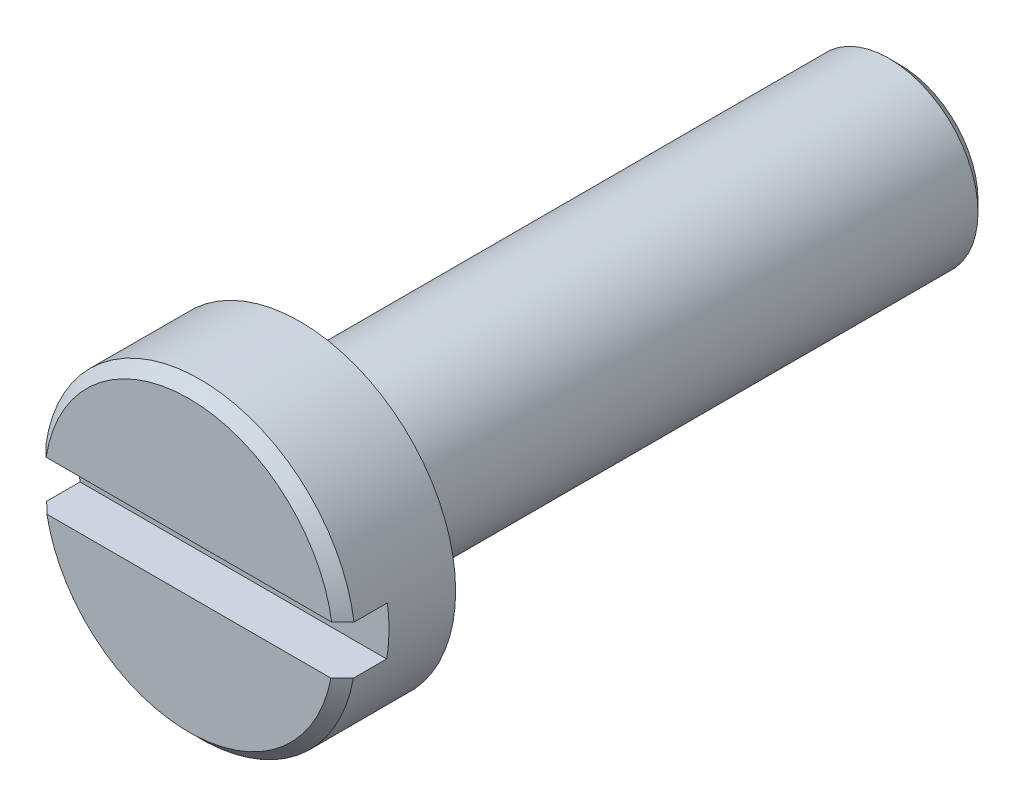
ISO-10303-21;
HEADER;
FILE_DESCRIPTION(('STEP AP214'),'2;1');
FILE_NAME('part.step','',(''),(''),'','','');
FILE_SCHEMA(('AUTOMOTIVE_DESIGN { 1 0 10303 214 1 1 1 1 }'));
ENDSEC;
DATA;
#1=APPLICATION_CONTEXT('core data for automotive mechanical design processes');
#2=APPLICATION_PROTOCOL_DEFINITION('international standard','automotive_design',2000,#1);
#3=PRODUCT_CONTEXT('',#1,'mechanical');
#4=PRODUCT('Part','Part','',(#3));
#5=PRODUCT_RELATED_PRODUCT_CATEGORY('part','',(#4));
#6=PRODUCT_DEFINITION_FORMATION('','',#4);
#7=PRODUCT_DEFINITION_CONTEXT('part definition',#1,'design');
#8=PRODUCT_DEFINITION('design','',#6,#7);
#9=PRODUCT_DEFINITION_SHAPE('','',#8);
#10=(LENGTH_UNIT() NAMED_UNIT(*) SI_UNIT(.MILLI.,.METRE.));
#11=(NAMED_UNIT(*) PLANE_ANGLE_UNIT() SI_UNIT($,.RADIAN.));
#12=(NAMED_UNIT(*) SI_UNIT($,.STERADIAN.) SOLID_ANGLE_UNIT());
#13=UNCERTAINTY_MEASURE_WITH_UNIT(LENGTH_MEASURE(1.E-05),#10,'distance_accuracy_value','');
#14=(GEOMETRIC_REPRESENTATION_CONTEXT(3) GLOBAL_UNCERTAINTY_ASSIGNED_CONTEXT((#13)) GLOBAL_UNIT_ASSIGNED_CONTEXT((#10,
#11,#12)) REPRESENTATION_CONTEXT('',''));
#15=CARTESIAN_POINT('',(0.,0.,0.));
#16=DIRECTION('',(0.,0.,1.));
#17=DIRECTION('',(1.,0.,0.));
#18=AXIS2_PLACEMENT_3D('',#15,#16,#17);
#19=CARTESIAN_POINT('',(0.,0.,0.));
#20=DIRECTION('',(0.,0.,-1.));
#21=DIRECTION('',(-1.,0.,0.));
#22=AXIS2_PLACEMENT_3D('',#19,#20,#21);
#23=PLANE('',#22);
#24=CARTESIAN_POINT('',(0.,0.,0.));
#25=DIRECTION('',(0.,0.,-1.));
#26=DIRECTION('',(-1.,0.,0.));
#27=AXIS2_PLACEMENT_3D('',#24,#25,#26);
#28=CIRCLE('',#27,20.6375);
#29=CARTESIAN_POINT('',(20.3918067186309,3.175,0.));
#30=VERTEX_POINT('',#29);
#31=CARTESIAN_POINT('',(-20.3918067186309,3.175,0.));
#32=VERTEX_POINT('',#31);
#33=EDGE_CURVE('E133',#30,#32,#28,.F.);
#34=ORIENTED_EDGE('',*,*,#33,.T.);
#35=DIRECTION('',(-1.,0.,0.));
#36=VECTOR('',#35,1.);
#37=CARTESIAN_POINT('',(-21.9970452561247,3.175,0.));
#38=LINE('',#37,#36);
#39=EDGE_CURVE('E107',#30,#32,#38,.T.);
#40=ORIENTED_EDGE('',*,*,#39,.F.);
#41=EDGE_LOOP('',(#34,#40));
#42=FACE_BOUND('',#41,.T.);
#43=ADVANCED_FACE('F34',(#42),#23,.F.);
#44=CARTESIAN_POINT('',(0.,0.,0.));
#45=DIRECTION('',(0.,0.,-1.));
#46=DIRECTION('',(-1.,0.,0.));
#47=AXIS2_PLACEMENT_3D('',#44,#45,#46);
#48=CONICAL_SURFACE('',#47,20.6375,0.785398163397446);
#49=CARTESIAN_POINT('',(48.4108791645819,3.175,-27.8773827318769));
#50=CARTESIAN_POINT('',(46.7448659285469,3.175,-26.2149705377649));
#51=CARTESIAN_POINT('',(45.0786964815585,3.175,-24.5527147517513));
#52=CARTESIAN_POINT('',(41.7458081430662,3.175,-21.2286870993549));
#53=CARTESIAN_POINT('',(40.0790892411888,3.175,-19.5669152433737));
#54=CARTESIAN_POINT('',(36.7441758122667,3.175,-16.243339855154));
#55=CARTESIAN_POINT('',(35.0759809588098,3.175,-14.5815366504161));
#56=CARTESIAN_POINT('',(31.7385378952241,3.175,-11.2590534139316));
#57=CARTESIAN_POINT('',(30.0692897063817,3.175,-9.59837336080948));
#58=CARTESIAN_POINT('',(27.5540482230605,3.175,-7.09871347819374));
#59=CARTESIAN_POINT('',(26.708714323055,3.175,-6.25907019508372));
#60=CARTESIAN_POINT('',(25.0174396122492,3.175,-4.58039517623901));
#61=CARTESIAN_POINT('',(24.1714988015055,3.175,-3.7413634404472));
#62=CARTESIAN_POINT('',(22.4787457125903,3.175,-2.06407637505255));
#63=CARTESIAN_POINT('',(21.6319333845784,3.175,-1.22582109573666));
#64=CARTESIAN_POINT('',(19.9371605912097,3.175,0.449518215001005));
#65=CARTESIAN_POINT('',(19.0892001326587,3.175,1.28660225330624));
#66=CARTESIAN_POINT('',(17.3918403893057,3.175,2.95883094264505));
#67=CARTESIAN_POINT('',(16.5424415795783,3.175,3.79397607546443));
#68=CARTESIAN_POINT('',(15.2663654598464,3.175,5.04469611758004));
#69=CARTESIAN_POINT('',(14.8406720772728,3.175,5.46127474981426));
#70=CARTESIAN_POINT('',(13.9884364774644,3.175,6.29356264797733));
#71=CARTESIAN_POINT('',(13.5618942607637,3.175,6.70927191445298));
#72=CARTESIAN_POINT('',(12.707747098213,3.175,7.53950827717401));
#73=CARTESIAN_POINT('',(12.2801422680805,3.175,7.95403549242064));
#74=CARTESIAN_POINT('',(11.4234486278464,3.175,8.78155291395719));
#75=CARTESIAN_POINT('',(10.9943598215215,3.175,9.19454312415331));
#76=CARTESIAN_POINT('',(10.1341408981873,3.175,10.018361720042));
#77=CARTESIAN_POINT('',(9.70301085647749,3.175,10.4291901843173));
#78=CARTESIAN_POINT('',(8.83780924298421,3.175,11.2477356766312));
#79=CARTESIAN_POINT('',(8.40373771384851,3.175,11.6554527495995));
#80=CARTESIAN_POINT('',(7.84908814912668,3.175,12.1706862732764));
#81=CARTESIAN_POINT('',(7.73058536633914,3.175,12.2804371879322));
#82=CARTESIAN_POINT('',(7.49320021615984,3.175,12.4995287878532));
#83=CARTESIAN_POINT('',(7.37431784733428,3.175,12.6088694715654));
#84=CARTESIAN_POINT('',(7.13612183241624,3.175,12.8270851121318));
#85=CARTESIAN_POINT('',(7.0168081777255,3.175,12.9359600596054));
#86=CARTESIAN_POINT('',(6.77768977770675,3.175,13.1531690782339));
#87=CARTESIAN_POINT('',(6.65788503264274,3.175,13.2615031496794));
#88=CARTESIAN_POINT('',(6.29770692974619,3.175,13.5855008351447));
#89=CARTESIAN_POINT('',(6.05649197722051,3.175,13.8002313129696));
#90=CARTESIAN_POINT('',(5.57106720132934,3.175,14.2262732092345));
#91=CARTESIAN_POINT('',(5.32685750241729,3.175,14.4375847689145));
#92=CARTESIAN_POINT('',(4.89899238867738,3.175,14.8004179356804));
#93=CARTESIAN_POINT('',(4.71628828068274,3.175,14.9530591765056));
#94=CARTESIAN_POINT('',(4.34791082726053,3.175,15.2547729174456));
#95=CARTESIAN_POINT('',(4.16223716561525,3.175,15.4038450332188));
#96=CARTESIAN_POINT('',(3.78679947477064,3.175,15.6971840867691));
#97=CARTESIAN_POINT('',(3.59703132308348,3.175,15.8414457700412));
#98=CARTESIAN_POINT('',(3.21228765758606,3.175,16.1228440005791));
#99=CARTESIAN_POINT('',(3.01731344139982,3.175,16.2599822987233));
#100=CARTESIAN_POINT('',(2.69305087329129,3.175,16.4752446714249));
#101=CARTESIAN_POINT('',(2.56589455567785,3.175,16.5565678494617));
#102=CARTESIAN_POINT('',(2.30806509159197,3.175,16.7135597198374));
#103=CARTESIAN_POINT('',(2.17739114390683,3.175,16.7892271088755));
#104=CARTESIAN_POINT('',(1.91209259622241,3.175,16.9328676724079));
#105=CARTESIAN_POINT('',(1.77747418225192,3.175,17.0008521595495));
#106=CARTESIAN_POINT('',(1.50353169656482,3.175,17.1265958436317));
#107=CARTESIAN_POINT('',(1.36421045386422,3.175,17.1843610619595));
#108=CARTESIAN_POINT('',(1.1295248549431,3.175,17.2686801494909));
#109=CARTESIAN_POINT('',(1.03556404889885,3.175,17.2991287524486));
#110=CARTESIAN_POINT('',(0.845678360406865,3.175,17.353064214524));
#111=CARTESIAN_POINT('',(0.749754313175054,3.175,17.3765539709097));
#112=CARTESIAN_POINT('',(0.556561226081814,3.175,17.4154713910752));
#113=CARTESIAN_POINT('',(0.459297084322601,3.175,17.4309230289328));
#114=CARTESIAN_POINT('',(0.263765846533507,3.175,17.4530426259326));
#115=CARTESIAN_POINT('',(0.1654988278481,3.175,17.4597112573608));
#116=CARTESIAN_POINT('',(-0.0317508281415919,3.175,17.4638803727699));
#117=CARTESIAN_POINT('',(-0.130734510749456,3.175,17.4613324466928));
#118=CARTESIAN_POINT('',(-0.328037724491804,3.175,17.4471165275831));
#119=CARTESIAN_POINT('',(-0.426357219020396,3.175,17.4354480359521));
#120=CARTESIAN_POINT('',(-0.621827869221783,3.175,17.4036222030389));
#121=CARTESIAN_POINT('',(-0.718975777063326,3.175,17.3834451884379));
#122=CARTESIAN_POINT('',(-0.91138277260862,3.175,17.3355980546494));
#123=CARTESIAN_POINT('',(-1.00664165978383,3.175,17.3079271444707));
#124=CARTESIAN_POINT('',(-1.29457057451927,3.175,17.2136157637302));
#125=CARTESIAN_POINT('',(-1.48389036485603,3.175,17.1366783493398));
#126=CARTESIAN_POINT('',(-1.76133338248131,3.175,17.007593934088));
#127=CARTESIAN_POINT('',(-1.8528173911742,3.175,16.9622313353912));
#128=CARTESIAN_POINT('',(-2.03382268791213,3.175,16.8677387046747));
#129=CARTESIAN_POINT('',(-2.12334426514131,3.175,16.8186092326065));
#130=CARTESIAN_POINT('',(-2.30133097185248,3.175,16.7168655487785));
#131=CARTESIAN_POINT('',(-2.38978166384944,3.175,16.664226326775));
#132=CARTESIAN_POINT('',(-2.56509891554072,3.175,16.5563747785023));
#133=CARTESIAN_POINT('',(-2.65196544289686,3.175,16.5011623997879));
#134=CARTESIAN_POINT('',(-2.8242278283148,3.175,16.388660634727));
#135=CARTESIAN_POINT('',(-2.9096249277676,3.175,16.3313731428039));
#136=CARTESIAN_POINT('',(-3.0791953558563,3.175,16.2150262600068));
#137=CARTESIAN_POINT('',(-3.16336872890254,3.175,16.1559669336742));
#138=CARTESIAN_POINT('',(-3.42855103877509,3.175,15.9663751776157));
#139=CARTESIAN_POINT('',(-3.6075936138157,3.175,15.833091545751));
#140=CARTESIAN_POINT('',(-3.9619296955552,3.175,15.5616157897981));
#141=CARTESIAN_POINT('',(-4.13722257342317,3.175,15.423422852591));
#142=CARTESIAN_POINT('',(-4.48500444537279,3.175,15.1433887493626));
#143=CARTESIAN_POINT('',(-4.65749201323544,3.175,15.001545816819));
#144=CARTESIAN_POINT('',(-5.00022285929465,3.175,14.7151689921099));
#145=CARTESIAN_POINT('',(-5.17046604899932,3.175,14.5706349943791));
#146=CARTESIAN_POINT('',(-5.50947908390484,3.175,14.2792401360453));
#147=CARTESIAN_POINT('',(-5.67824572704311,3.175,14.1323755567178));
#148=CARTESIAN_POINT('',(-6.01434716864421,3.175,13.8370155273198));
#149=CARTESIAN_POINT('',(-6.18168194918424,3.175,13.6885200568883));
#150=CARTESIAN_POINT('',(-6.68185050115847,3.175,13.2411926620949));
#151=CARTESIAN_POINT('',(-7.01295465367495,3.175,12.9404277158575));
#152=CARTESIAN_POINT('',(-7.67104263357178,3.175,12.3363762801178));
#153=CARTESIAN_POINT('',(-7.99803574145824,3.175,12.0330998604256));
#154=CARTESIAN_POINT('',(-8.64980355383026,3.175,11.4241266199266));
#155=CARTESIAN_POINT('',(-8.97457809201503,3.175,11.1184296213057));
#156=CARTESIAN_POINT('',(-9.62211308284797,3.175,10.50563089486));
#157=CARTESIAN_POINT('',(-9.94487537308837,3.175,10.1985311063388));
#158=CARTESIAN_POINT('',(-10.5891357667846,3.175,9.58302539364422));
#159=CARTESIAN_POINT('',(-10.9106339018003,3.175,9.27461950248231));
#160=CARTESIAN_POINT('',(-11.8706003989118,3.175,8.35086874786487));
#161=CARTESIAN_POINT('',(-12.507642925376,3.175,7.73404268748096));
#162=CARTESIAN_POINT('',(-13.7793142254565,3.175,6.49790614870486));
#163=CARTESIAN_POINT('',(-14.4139429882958,3.175,5.87859565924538));
#164=CARTESIAN_POINT('',(-15.6815669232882,3.175,4.63827993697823));
#165=CARTESIAN_POINT('',(-16.3145620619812,3.175,4.01727466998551));
#166=CARTESIAN_POINT('',(-17.5793843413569,3.175,2.77407554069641));
#167=CARTESIAN_POINT('',(-18.2112114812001,3.175,2.15188167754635));
#168=CARTESIAN_POINT('',(-20.1059816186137,3.175,0.283470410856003));
#169=CARTESIAN_POINT('',(-21.3676575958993,3.175,-0.96403162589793));
#170=CARTESIAN_POINT('',(-23.8890487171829,3.175,-3.46098988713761));
#171=CARTESIAN_POINT('',(-25.1487638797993,3.175,-4.71044609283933));
#172=CARTESIAN_POINT('',(-27.6667937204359,3.175,-7.21047127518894));
#173=CARTESIAN_POINT('',(-28.9251085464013,3.175,-8.46104010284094));
#174=CARTESIAN_POINT('',(-31.4408967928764,3.175,-10.9630299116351));
#175=CARTESIAN_POINT('',(-32.6983702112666,3.175,-12.214450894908));
#176=CARTESIAN_POINT('',(-36.4696321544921,3.175,-15.9693185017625));
#177=CARTESIAN_POINT('',(-38.9825419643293,3.175,-18.4736476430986));
#178=CARTESIAN_POINT('',(-42.0712766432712,3.175,-21.5533895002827));
#179=CARTESIAN_POINT('',(-42.647700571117,3.175,-22.1282017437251));
#180=CARTESIAN_POINT('',(-43.8004959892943,3.175,-23.2778987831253));
#181=CARTESIAN_POINT('',(-44.3768674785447,3.175,-23.8527835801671));
#182=CARTESIAN_POINT('',(-45.5295455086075,3.175,-25.0025975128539));
#183=CARTESIAN_POINT('',(-46.105852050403,3.175,-25.5775266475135));
#184=CARTESIAN_POINT('',(-47.2584060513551,3.175,-26.7274241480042));
#185=CARTESIAN_POINT('',(-47.8346535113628,3.175,-27.3023925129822));
#186=CARTESIAN_POINT('',(-48.4108791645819,3.175,-27.8773827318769));
#187=B_SPLINE_CURVE_WITH_KNOTS('',3,(#49,#50,#51,#52,#53,#54,#55,#56,#57,#58,#59,#60,#61,#62,
#63,#64,#65,#66,#67,#68,#69,#70,#71,#72,#73,#74,#75,#76,#77,#78,#79,#80,#81,#82,#83,#84,#85,#86,
#87,#88,#89,#90,#91,#92,#93,#94,#95,#96,#97,#98,#99,#100,#101,#102,#103,#104,#105,#106,#107,
#108,#109,#110,#111,#112,#113,#114,#115,#116,#117,#118,#119,#120,#121,#122,#123,#124,#125,#126,
#127,#128,#129,#130,#131,#132,#133,#134,#135,#136,#137,#138,#139,#140,#141,#142,#143,#144,#145,
#146,#147,#148,#149,#150,#151,#152,#153,#154,#155,#156,#157,#158,#159,#160,#161,#162,#163,#164,
#165,#166,#167,#168,#169,#170,#171,#172,#173,#174,#175,#176,#177,#178,#179,#180,#181,#182,#183,
#184,#185,#186),.UNSPECIFIED.,.F.,.F.,(4,2,2,2,2,2,2,2,2,2,2,2,2,2,2,2,2,2,2,2,2,2,2,2,2,2,2,2,
2,2,2,2,2,2,2,2,2,2,2,2,2,2,2,2,2,2,2,2,2,2,2,2,2,2,2,2,2,2,2,2,2,2,2,2,2,2,2,2,4),(0.,
7.06066085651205,14.1214636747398,21.1854690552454,28.2493359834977,31.8237325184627,
35.3981287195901,38.97274216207,42.5473345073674,46.1209152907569,47.9077477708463,
49.6945791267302,51.4812237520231,53.2678638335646,55.0544385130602,56.8409873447,
57.3255415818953,57.8100976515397,58.2946634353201,58.7792289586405,59.7480434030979,
60.7168177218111,61.4310136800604,62.1452862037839,62.8603149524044,63.575167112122,
64.027873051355,64.4806829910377,64.9328172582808,65.3846842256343,65.6807787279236,
65.9767497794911,66.2718329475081,66.5668935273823,66.8635061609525,67.1601350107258,
67.4574535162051,67.7548034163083,68.3661255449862,68.6724293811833,68.9786877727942,
69.2874276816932,69.5961738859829,69.9046450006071,70.2131048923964,70.8825830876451,
71.5521726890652,72.2220926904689,72.8920390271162,73.5631907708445,74.2343509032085,
75.5762496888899,76.9141855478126,78.2522206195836,79.588768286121,80.9252823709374,
83.585472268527,86.2456740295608,88.9059298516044,91.5661875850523,96.8890382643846,
102.211838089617,107.534008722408,112.85619271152,123.499378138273,125.941521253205,
128.383706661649,130.825848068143,133.267947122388),.UNSPECIFIED.);
#188=CARTESIAN_POINT('',(21.9970452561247,3.175,-1.5875));
#189=VERTEX_POINT('',#188);
#190=EDGE_CURVE('E11',#189,#30,#187,.T.);
#191=ORIENTED_EDGE('',*,*,#190,.F.);
#192=CARTESIAN_POINT('',(0.,0.,-1.5875));
#193=DIRECTION('',(0.,0.,-1.));
#194=DIRECTION('',(-1.,0.,0.));
#195=AXIS2_PLACEMENT_3D('',#192,#193,#194);
#196=CIRCLE('',#195,22.225);
#197=CARTESIAN_POINT('',(-21.9970452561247,3.175,-1.5875));
#198=VERTEX_POINT('',#197);
#199=EDGE_CURVE('E137',#198,#189,#196,.T.);
#200=ORIENTED_EDGE('',*,*,#199,.F.);
#201=EDGE_CURVE('E38',#32,#198,#187,.T.);
#202=ORIENTED_EDGE('',*,*,#201,.F.);
#203=ORIENTED_EDGE('',*,*,#33,.F.);
#204=EDGE_LOOP('',(#191,#200,#202,#203));
#205=FACE_BOUND('',#204,.T.);
#206=ADVANCED_FACE('F158',(#205),#48,.T.);
#207=CARTESIAN_POINT('',(-20.2827588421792,-3.81,0.));
#208=VERTEX_POINT('',#207);
#209=CARTESIAN_POINT('',(20.2827588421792,-3.81,0.));
#210=VERTEX_POINT('',#209);
#211=EDGE_CURVE('E134',#208,#210,#28,.F.);
#212=ORIENTED_EDGE('',*,*,#211,.T.);
#213=DIRECTION('',(1.,0.,0.));
#214=VECTOR('',#213,1.);
#215=CARTESIAN_POINT('',(-21.8959933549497,-3.81,0.));
#216=LINE('',#215,#214);
#217=EDGE_CURVE('E54',#208,#210,#216,.T.);
#218=ORIENTED_EDGE('',*,*,#217,.F.);
#219=EDGE_LOOP('',(#212,#218));
#220=FACE_BOUND('',#219,.T.);
#221=ADVANCED_FACE('F36',(#220),#23,.F.);
#222=CARTESIAN_POINT('',(0.,0.,0.));
#223=DIRECTION('',(0.,0.,1.));
#224=DIRECTION('',(1.,0.,0.));
#225=AXIS2_PLACEMENT_3D('',#222,#223,#224);
#226=CYLINDRICAL_SURFACE('',#225,22.225);
#227=CARTESIAN_POINT('',(0.,0.,-6.35));
#228=DIRECTION('',(0.,0.,1.));
#229=DIRECTION('',(1.,0.,0.));
#230=AXIS2_PLACEMENT_3D('',#227,#228,#229);
#231=CIRCLE('',#230,22.225);
#232=CARTESIAN_POINT('',(-21.9970452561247,3.175,-6.35));
#233=VERTEX_POINT('',#232);
#234=CARTESIAN_POINT('',(-21.8959933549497,-3.81,-6.35));
#235=VERTEX_POINT('',#234);
#236=EDGE_CURVE('E99',#233,#235,#231,.T.);
#237=ORIENTED_EDGE('',*,*,#236,.F.);
#238=DIRECTION('',(0.,0.,1.));
#239=VECTOR('',#238,1.);
#240=CARTESIAN_POINT('',(-21.9970452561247,3.175,-6.35));
#241=LINE('',#240,#239);
#242=EDGE_CURVE('E124',#233,#198,#241,.T.);
#243=ORIENTED_EDGE('',*,*,#242,.T.);
#244=ORIENTED_EDGE('',*,*,#199,.T.);
#245=DIRECTION('',(0.,0.,1.));
#246=VECTOR('',#245,1.);
#247=CARTESIAN_POINT('',(21.9970452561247,3.175,-6.35));
#248=LINE('',#247,#246);
#249=CARTESIAN_POINT('',(21.9970452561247,3.175,-6.35));
#250=VERTEX_POINT('',#249);
#251=EDGE_CURVE('E115',#250,#189,#248,.T.);
#252=ORIENTED_EDGE('',*,*,#251,.F.);
#253=CARTESIAN_POINT('',(0.,0.,-6.35));
#254=DIRECTION('',(0.,0.,1.));
#255=DIRECTION('',(1.,0.,0.));
#256=AXIS2_PLACEMENT_3D('',#253,#254,#255);
#257=CIRCLE('',#256,22.225);
#258=CARTESIAN_POINT('',(21.8959933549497,-3.81000000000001,-6.35));
#259=VERTEX_POINT('',#258);
#260=EDGE_CURVE('E98',#259,#250,#257,.T.);
#261=ORIENTED_EDGE('',*,*,#260,.F.);
#262=DIRECTION('',(0.,0.,1.));
#263=VECTOR('',#262,1.);
#264=CARTESIAN_POINT('',(21.8959933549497,-3.81000000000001,-6.35));
#265=LINE('',#264,#263);
#266=CARTESIAN_POINT('',(21.8959933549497,-3.81000000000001,-1.5875));
#267=VERTEX_POINT('',#266);
#268=EDGE_CURVE('E95',#259,#267,#265,.T.);
#269=ORIENTED_EDGE('',*,*,#268,.T.);
#270=CARTESIAN_POINT('',(-21.8959933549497,-3.81,-1.5875));
#271=VERTEX_POINT('',#270);
#272=EDGE_CURVE('E113',#267,#271,#196,.T.);
#273=ORIENTED_EDGE('',*,*,#272,.T.);
#274=DIRECTION('',(0.,0.,1.));
#275=VECTOR('',#274,1.);
#276=CARTESIAN_POINT('',(-21.8959933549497,-3.81,-6.35));
#277=LINE('',#276,#275);
#278=EDGE_CURVE('E92',#235,#271,#277,.T.);
#279=ORIENTED_EDGE('',*,*,#278,.F.);
#280=EDGE_LOOP('',(#237,#243,#244,#252,#261,#269,#273,#279));
#281=FACE_BOUND('',#280,.T.);
#282=CARTESIAN_POINT('',(0.,0.,-15.875));
#283=DIRECTION('',(0.,0.,1.));
#284=DIRECTION('',(1.,0.,0.));
#285=AXIS2_PLACEMENT_3D('',#282,#283,#284);
#286=CIRCLE('',#285,22.225);
#287=CARTESIAN_POINT('',(22.225,0.,-15.875));
#288=VERTEX_POINT('',#287);
#289=EDGE_CURVE('E123',#288,#288,#286,.T.);
#290=ORIENTED_EDGE('',*,*,#289,.T.);
#291=EDGE_LOOP('',(#290));
#292=FACE_BOUND('',#291,.T.);
#293=ADVANCED_FACE('F110',(#281,#292),#226,.T.);
#294=CARTESIAN_POINT('',(0.,22.225,-15.875));
#295=DIRECTION('',(0.,0.,1.));
#296=DIRECTION('',(1.,0.,0.));
#297=AXIS2_PLACEMENT_3D('',#294,#295,#296);
#298=PLANE('',#297);
#299=ORIENTED_EDGE('',*,*,#289,.F.);
#300=EDGE_LOOP('',(#299));
#301=FACE_BOUND('',#300,.T.);
#302=CARTESIAN_POINT('',(0.,0.,-15.875));
#303=DIRECTION('',(0.,0.,1.));
#304=DIRECTION('',(1.,0.,0.));
#305=AXIS2_PLACEMENT_3D('',#302,#303,#304);
#306=CIRCLE('',#305,12.7);
#307=CARTESIAN_POINT('',(12.7,0.,-15.875));
#308=VERTEX_POINT('',#307);
#309=EDGE_CURVE('E120',#308,#308,#306,.T.);
#310=ORIENTED_EDGE('',*,*,#309,.T.);
#311=EDGE_LOOP('',(#310));
#312=FACE_BOUND('',#311,.T.);
#313=ADVANCED_FACE('F170',(#301,#312),#298,.F.);
#314=CARTESIAN_POINT('',(0.,0.,0.));
#315=DIRECTION('',(0.,0.,1.));
#316=DIRECTION('',(1.,0.,0.));
#317=AXIS2_PLACEMENT_3D('',#314,#315,#316);
#318=CYLINDRICAL_SURFACE('',#317,12.7);
#319=CARTESIAN_POINT('',(0.,0.,-100.0125));
#320=DIRECTION('',(0.,0.,1.));
#321=DIRECTION('',(1.,0.,0.));
#322=AXIS2_PLACEMENT_3D('',#319,#320,#321);
#323=CIRCLE('',#322,12.7);
#324=CARTESIAN_POINT('',(12.7,0.,-100.0125));
#325=VERTEX_POINT('',#324);
#326=EDGE_CURVE('E127',#325,#325,#323,.T.);
#327=ORIENTED_EDGE('',*,*,#326,.T.);
#328=EDGE_LOOP('',(#327));
#329=FACE_BOUND('',#328,.T.);
#330=ORIENTED_EDGE('',*,*,#309,.F.);
#331=EDGE_LOOP('',(#330));
#332=FACE_BOUND('',#331,.T.);
#333=ADVANCED_FACE('F192',(#329,#332),#318,.T.);
#334=CARTESIAN_POINT('',(0.,12.7,-101.6));
#335=DIRECTION('',(0.,0.,1.));
#336=DIRECTION('',(1.,0.,0.));
#337=AXIS2_PLACEMENT_3D('',#334,#335,#336);
#338=PLANE('',#337);
#339=CARTESIAN_POINT('',(0.,0.,-101.6));
#340=DIRECTION('',(0.,0.,1.));
#341=DIRECTION('',(1.,0.,0.));
#342=AXIS2_PLACEMENT_3D('',#339,#340,#341);
#343=CIRCLE('',#342,11.1125);
#344=CARTESIAN_POINT('',(11.1125,0.,-101.6));
#345=VERTEX_POINT('',#344);
#346=EDGE_CURVE('E130',#345,#345,#343,.F.);
#347=ORIENTED_EDGE('',*,*,#346,.T.);
#348=EDGE_LOOP('',(#347));
#349=FACE_BOUND('',#348,.T.);
#350=ADVANCED_FACE('F187',(#349),#338,.F.);
#351=CARTESIAN_POINT('',(0.,0.,-100.0125));
#352=DIRECTION('',(0.,0.,1.));
#353=DIRECTION('',(1.,0.,0.));
#354=AXIS2_PLACEMENT_3D('',#351,#352,#353);
#355=CONICAL_SURFACE('',#354,12.7,0.785398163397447);
#356=CARTESIAN_POINT('',(11.1125,0.,-101.6));
#357=CARTESIAN_POINT('',(11.1290364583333,0.,-101.583463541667));
#358=CARTESIAN_POINT('',(11.1455729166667,0.,-101.566927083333));
#359=CARTESIAN_POINT('',(11.1786458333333,0.,-101.533854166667));
#360=CARTESIAN_POINT('',(11.1951822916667,0.,-101.517317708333));
#361=CARTESIAN_POINT('',(11.2282552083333,0.,-101.484244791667));
#362=CARTESIAN_POINT('',(11.2447916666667,0.,-101.467708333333));
#363=CARTESIAN_POINT('',(11.2778645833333,0.,-101.434635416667));
#364=CARTESIAN_POINT('',(11.2944010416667,0.,-101.418098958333));
#365=CARTESIAN_POINT('',(11.3274739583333,0.,-101.385026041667));
#366=CARTESIAN_POINT('',(11.3440104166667,0.,-101.368489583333));
#367=CARTESIAN_POINT('',(11.3770833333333,0.,-101.335416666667));
#368=CARTESIAN_POINT('',(11.3936197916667,0.,-101.318880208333));
#369=CARTESIAN_POINT('',(11.4266927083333,0.,-101.285807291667));
#370=CARTESIAN_POINT('',(11.4432291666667,0.,-101.269270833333));
#371=CARTESIAN_POINT('',(11.4763020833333,0.,-101.236197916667));
#372=CARTESIAN_POINT('',(11.4928385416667,0.,-101.219661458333));
#373=CARTESIAN_POINT('',(11.5259114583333,0.,-101.186588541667));
#374=CARTESIAN_POINT('',(11.5424479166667,0.,-101.170052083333));
#375=CARTESIAN_POINT('',(11.5755208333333,0.,-101.136979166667));
#376=CARTESIAN_POINT('',(11.5920572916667,0.,-101.120442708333));
#377=CARTESIAN_POINT('',(11.6251302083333,0.,-101.087369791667));
#378=CARTESIAN_POINT('',(11.6416666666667,0.,-101.070833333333));
#379=CARTESIAN_POINT('',(11.6747395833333,0.,-101.037760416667));
#380=CARTESIAN_POINT('',(11.6912760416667,0.,-101.021223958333));
#381=CARTESIAN_POINT('',(11.7243489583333,0.,-100.988151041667));
#382=CARTESIAN_POINT('',(11.7408854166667,0.,-100.971614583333));
#383=CARTESIAN_POINT('',(11.7739583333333,0.,-100.938541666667));
#384=CARTESIAN_POINT('',(11.7904947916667,0.,-100.922005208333));
#385=CARTESIAN_POINT('',(11.8235677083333,0.,-100.888932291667));
#386=CARTESIAN_POINT('',(11.8401041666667,0.,-100.872395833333));
#387=CARTESIAN_POINT('',(11.8731770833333,0.,-100.839322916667));
#388=CARTESIAN_POINT('',(11.8897135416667,0.,-100.822786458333));
#389=CARTESIAN_POINT('',(11.9227864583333,0.,-100.789713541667));
#390=CARTESIAN_POINT('',(11.9393229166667,0.,-100.773177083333));
#391=CARTESIAN_POINT('',(11.9723958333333,0.,-100.740104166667));
#392=CARTESIAN_POINT('',(11.9889322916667,0.,-100.723567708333));
#393=CARTESIAN_POINT('',(12.0220052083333,0.,-100.690494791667));
#394=CARTESIAN_POINT('',(12.0385416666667,0.,-100.673958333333));
#395=CARTESIAN_POINT('',(12.0716145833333,0.,-100.640885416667));
#396=CARTESIAN_POINT('',(12.0881510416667,0.,-100.624348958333));
#397=CARTESIAN_POINT('',(12.1212239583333,0.,-100.591276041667));
#398=CARTESIAN_POINT('',(12.1377604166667,0.,-100.574739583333));
#399=CARTESIAN_POINT('',(12.1708333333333,0.,-100.541666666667));
#400=CARTESIAN_POINT('',(12.1873697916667,0.,-100.525130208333));
#401=CARTESIAN_POINT('',(12.2204427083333,0.,-100.492057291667));
#402=CARTESIAN_POINT('',(12.2369791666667,0.,-100.475520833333));
#403=CARTESIAN_POINT('',(12.2700520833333,0.,-100.442447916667));
#404=CARTESIAN_POINT('',(12.2865885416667,0.,-100.425911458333));
#405=CARTESIAN_POINT('',(12.3196614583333,0.,-100.392838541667));
#406=CARTESIAN_POINT('',(12.3361979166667,0.,-100.376302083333));
#407=CARTESIAN_POINT('',(12.3692708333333,0.,-100.343229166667));
#408=CARTESIAN_POINT('',(12.3858072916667,0.,-100.326692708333));
#409=CARTESIAN_POINT('',(12.4188802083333,0.,-100.293619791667));
#410=CARTESIAN_POINT('',(12.4354166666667,0.,-100.277083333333));
#411=CARTESIAN_POINT('',(12.4684895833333,0.,-100.244010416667));
#412=CARTESIAN_POINT('',(12.4850260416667,0.,-100.227473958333));
#413=CARTESIAN_POINT('',(12.5180989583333,0.,-100.194401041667));
#414=CARTESIAN_POINT('',(12.5346354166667,0.,-100.177864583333));
#415=CARTESIAN_POINT('',(12.5677083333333,0.,-100.144791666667));
#416=CARTESIAN_POINT('',(12.5842447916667,0.,-100.128255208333));
#417=CARTESIAN_POINT('',(12.6173177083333,0.,-100.095182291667));
#418=CARTESIAN_POINT('',(12.6338541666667,0.,-100.078645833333));
#419=CARTESIAN_POINT('',(12.6669270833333,0.,-100.045572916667));
#420=CARTESIAN_POINT('',(12.6834635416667,0.,-100.029036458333));
#421=CARTESIAN_POINT('',(12.7,0.,-100.0125));
#422=B_SPLINE_CURVE_WITH_KNOTS('',3,(#356,#357,#358,#359,#360,#361,#362,#363,#364,#365,#366,
#367,#368,#369,#370,#371,#372,#373,#374,#375,#376,#377,#378,#379,#380,#381,#382,#383,#384,#385,
#386,#387,#388,#389,#390,#391,#392,#393,#394,#395,#396,#397,#398,#399,#400,#401,#402,#403,#404,
#405,#406,#407,#408,#409,#410,#411,#412,#413,#414,#415,#416,#417,#418,#419,#420,#421),
.UNSPECIFIED.,.F.,.F.,(4,2,2,2,2,2,2,2,2,2,2,2,2,2,2,2,2,2,2,2,2,2,2,2,2,2,2,2,2,2,2,2,4),(0.,
0.0701582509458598,0.140316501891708,0.210474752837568,0.280633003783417,0.350791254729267,
0.420949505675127,0.491107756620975,0.561266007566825,0.631424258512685,0.701582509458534,
0.771740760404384,0.841899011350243,0.912057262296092,0.982215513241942,1.0523737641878,
1.12253201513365,1.1926902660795,1.26284851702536,1.33300676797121,1.40316501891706,
1.47332326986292,1.54348152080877,1.61363977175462,1.68379802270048,1.75395627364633,
1.82411452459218,1.89427277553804,1.96443102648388,2.03458927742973,2.10474752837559,
2.17490577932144,2.2450640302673),.UNSPECIFIED.);
#423=EDGE_CURVE('BSEAM183',#345,#325,#422,.T.);
#424=ORIENTED_EDGE('',*,*,#346,.F.);
#425=ORIENTED_EDGE('',*,*,#326,.F.);
#426=ORIENTED_EDGE('',*,*,#423,.T.);
#427=ORIENTED_EDGE('',*,*,#423,.F.);
#428=EDGE_LOOP('',(#424,#426,#425,#427));
#429=FACE_BOUND('',#428,.T.);
#430=ADVANCED_FACE('F183',(#429),#355,.T.);
#431=CARTESIAN_POINT('',(-48.1886442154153,-3.81,-27.7015270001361));
#432=CARTESIAN_POINT('',(-46.4760935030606,-3.81,-25.9943534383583));
#433=CARTESIAN_POINT('',(-44.7633060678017,-3.81,-24.2874169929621));
#434=CARTESIAN_POINT('',(-41.3368547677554,-3.81,-20.874277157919));
#435=CARTESIAN_POINT('',(-39.6231908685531,-3.81,-19.1680738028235));
#436=CARTESIAN_POINT('',(-36.1929556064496,-3.81,-15.7550394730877));
#437=CARTESIAN_POINT('',(-34.4763830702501,-3.81,-14.0482096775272));
#438=CARTESIAN_POINT('',(-31.0415691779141,-3.81,-10.6363723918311));
#439=CARTESIAN_POINT('',(-29.3233278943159,-3.81,-8.93136482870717));
#440=CARTESIAN_POINT('',(-26.7862722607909,-3.81,-6.41815107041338));
#441=CARTESIAN_POINT('',(-25.9685855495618,-3.81,-5.60880667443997));
#442=CARTESIAN_POINT('',(-24.3323294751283,-3.81,-3.99100489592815));
#443=CARTESIAN_POINT('',(-23.5137601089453,-3.81,-3.18254751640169));
#444=CARTESIAN_POINT('',(-21.875335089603,-3.81,-1.56673262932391));
#445=CARTESIAN_POINT('',(-21.0554792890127,-3.81,-0.759375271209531));
#446=CARTESIAN_POINT('',(-19.4141186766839,-3.81,0.853642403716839));
#447=CARTESIAN_POINT('',(-18.5926138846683,-3.81,1.65930274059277));
#448=CARTESIAN_POINT('',(-16.947715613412,-3.81,3.26766538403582));
#449=CARTESIAN_POINT('',(-16.1243236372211,-3.81,4.0703692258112));
#450=CARTESIAN_POINT('',(-14.8864230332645,-3.81,5.27156704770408));
#451=CARTESIAN_POINT('',(-14.4733106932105,-3.81,5.67149964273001));
#452=CARTESIAN_POINT('',(-13.6458879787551,-3.81,6.4701220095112));
#453=CARTESIAN_POINT('',(-13.2315776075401,-3.81,6.86881178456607));
#454=CARTESIAN_POINT('',(-12.4014917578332,-3.81,7.66448585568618));
#455=CARTESIAN_POINT('',(-11.9857166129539,-3.81,8.0614704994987));
#456=CARTESIAN_POINT('',(-11.1520965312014,-3.81,8.85325862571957));
#457=CARTESIAN_POINT('',(-10.7342516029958,-3.81,9.24806211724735));
#458=CARTESIAN_POINT('',(-9.89575932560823,-3.81,10.0346267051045));
#459=CARTESIAN_POINT('',(-9.47511218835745,-3.81,10.4263880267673));
#460=CARTESIAN_POINT('',(-8.8411092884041,-3.81,11.0107317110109));
#461=CARTESIAN_POINT('',(-8.62927182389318,-3.81,11.2049612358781));
#462=CARTESIAN_POINT('',(-8.20436093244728,-3.81,11.5920629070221));
#463=CARTESIAN_POINT('',(-7.99128751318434,-3.81,11.7849350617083));
#464=CARTESIAN_POINT('',(-7.65843798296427,-3.81,12.0838433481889));
#465=CARTESIAN_POINT('',(-7.53918546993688,-3.81,12.1904626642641));
#466=CARTESIAN_POINT('',(-7.30014755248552,-3.81,12.4031044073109));
#467=CARTESIAN_POINT('',(-7.18036214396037,-3.81,12.5091268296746));
#468=CARTESIAN_POINT('',(-6.94017747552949,-3.81,12.7204987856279));
#469=CARTESIAN_POINT('',(-6.81977815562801,-3.81,12.8258482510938));
#470=CARTESIAN_POINT('',(-6.57829337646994,-3.81,13.0357575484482));
#471=CARTESIAN_POINT('',(-6.45720791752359,-3.81,13.1403173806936));
#472=CARTESIAN_POINT('',(-6.09078781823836,-3.81,13.4543391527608));
#473=CARTESIAN_POINT('',(-5.8442545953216,-3.81,13.6624072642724));
#474=CARTESIAN_POINT('',(-5.34703341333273,-3.81,14.0734152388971));
#475=CARTESIAN_POINT('',(-5.09634658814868,-3.81,14.2763564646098));
#476=CARTESIAN_POINT('',(-4.71488633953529,-3.81,14.576142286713));
#477=CARTESIAN_POINT('',(-4.58626118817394,-3.81,14.6757192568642));
#478=CARTESIAN_POINT('',(-4.32727178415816,-3.81,14.872581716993));
#479=CARTESIAN_POINT('',(-4.1969075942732,-3.81,14.9698672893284));
#480=CARTESIAN_POINT('',(-3.93393707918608,-3.81,15.161747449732));
#481=CARTESIAN_POINT('',(-3.80132795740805,-3.81,15.2563382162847));
#482=CARTESIAN_POINT('',(-3.53364947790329,-3.81,15.4419754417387));
#483=CARTESIAN_POINT('',(-3.39858021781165,-3.81,15.5330220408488));
#484=CARTESIAN_POINT('',(-3.12656682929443,-3.81,15.7099321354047));
#485=CARTESIAN_POINT('',(-2.98964545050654,-3.81,15.7958304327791));
#486=CARTESIAN_POINT('',(-2.71234642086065,-3.81,15.9619687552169));
#487=CARTESIAN_POINT('',(-2.57196803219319,-3.81,16.0422075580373));
#488=CARTESIAN_POINT('',(-2.28755546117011,-3.81,16.1951285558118));
#489=CARTESIAN_POINT('',(-2.14353088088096,-3.81,16.2678284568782));
#490=CARTESIAN_POINT('',(-1.85105941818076,-3.81,16.4036169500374));
#491=CARTESIAN_POINT('',(-1.70261548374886,-3.81,16.4667117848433));
#492=CARTESIAN_POINT('',(-1.43753496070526,-3.81,16.5666990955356));
#493=CARTESIAN_POINT('',(-1.32190184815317,-3.81,16.606236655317));
#494=CARTESIAN_POINT('',(-1.08801587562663,-3.81,16.6767608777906));
#495=CARTESIAN_POINT('',(-0.969762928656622,-3.81,16.7077472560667));
#496=CARTESIAN_POINT('',(-0.731507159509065,-3.81,16.7596462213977));
#497=CARTESIAN_POINT('',(-0.611512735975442,-3.81,16.7805967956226));
#498=CARTESIAN_POINT('',(-0.37009936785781,-3.81,16.8114374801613));
#499=CARTESIAN_POINT('',(-0.248680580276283,-3.81,16.8213287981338));
#500=CARTESIAN_POINT('',(-0.00464047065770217,-3.81,16.8294616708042));
#501=CARTESIAN_POINT('',(0.117983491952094,-3.81,16.8276256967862));
#502=CARTESIAN_POINT('',(0.36248553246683,-3.81,16.8122416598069));
#503=CARTESIAN_POINT('',(0.484363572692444,-3.81,16.7986930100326));
#504=CARTESIAN_POINT('',(0.72673682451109,-3.81,16.7606628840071));
#505=CARTESIAN_POINT('',(0.84722702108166,-3.81,16.7361499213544));
#506=CARTESIAN_POINT('',(1.08580689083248,-3.81,16.6774875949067));
#507=CARTESIAN_POINT('',(1.2038962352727,-3.81,16.6433369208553));
#508=CARTESIAN_POINT('',(1.552927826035,-3.81,16.5290412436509));
#509=CARTESIAN_POINT('',(1.77993658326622,-3.81,16.436818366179));
#510=CARTESIAN_POINT('',(2.11261503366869,-3.81,16.2820889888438));
#511=CARTESIAN_POINT('',(2.22231038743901,-3.81,16.2277159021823));
#512=CARTESIAN_POINT('',(2.43934892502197,-3.81,16.1144532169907));
#513=CARTESIAN_POINT('',(2.54669245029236,-3.81,16.055564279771));
#514=CARTESIAN_POINT('',(2.76012648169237,-3.81,15.933600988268));
#515=CARTESIAN_POINT('',(2.86619942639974,-3.81,15.8704961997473));
#516=CARTESIAN_POINT('',(3.07644581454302,-3.81,15.7412004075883));
#517=CARTESIAN_POINT('',(3.18061922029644,-3.81,15.6750093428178));
#518=CARTESIAN_POINT('',(3.3872039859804,-3.81,15.5401347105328));
#519=CARTESIAN_POINT('',(3.48961680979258,-3.81,15.4714533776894));
#520=CARTESIAN_POINT('',(3.69297477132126,-3.81,15.33196499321));
#521=CARTESIAN_POINT('',(3.79391996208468,-3.81,15.2611580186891));
#522=CARTESIAN_POINT('',(4.11198371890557,-3.81,15.0338211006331));
#523=CARTESIAN_POINT('',(4.32674257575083,-3.81,14.8739886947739));
#524=CARTESIAN_POINT('',(4.75176126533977,-3.81,14.5484321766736));
#525=CARTESIAN_POINT('',(4.96202034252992,-3.81,14.3827070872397));
#526=CARTESIAN_POINT('',(5.37917449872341,-3.81,14.046876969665));
#527=CARTESIAN_POINT('',(5.58606784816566,-3.81,13.8767697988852));
#528=CARTESIAN_POINT('',(5.9971590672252,-3.81,13.5333268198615));
#529=CARTESIAN_POINT('',(6.20135685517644,-3.81,13.3599909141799));
#530=CARTESIAN_POINT('',(6.60798418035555,-3.81,13.0105259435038));
#531=CARTESIAN_POINT('',(6.81040987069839,-3.81,12.8343924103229));
#532=CARTESIAN_POINT('',(7.21354286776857,-3.81,12.4801674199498));
#533=CARTESIAN_POINT('',(7.41425015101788,-3.81,12.3020759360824));
#534=CARTESIAN_POINT('',(8.01416818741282,-3.81,11.7655917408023));
#535=CARTESIAN_POINT('',(8.41130286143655,-3.81,11.4048785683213));
#536=CARTESIAN_POINT('',(9.20057829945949,-3.81,10.6804691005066));
#537=CARTESIAN_POINT('',(9.59273066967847,-3.81,10.3167853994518));
#538=CARTESIAN_POINT('',(10.374373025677,-3.81,9.58651298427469));
#539=CARTESIAN_POINT('',(10.7638628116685,-3.81,9.21992405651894));
#540=CARTESIAN_POINT('',(11.5404224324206,-3.81,8.48506236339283));
#541=CARTESIAN_POINT('',(11.927494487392,-3.81,8.11679194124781));
#542=CARTESIAN_POINT('',(12.7001216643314,-3.81,7.37868367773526));
#543=CARTESIAN_POINT('',(13.0856768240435,-3.81,7.00884587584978));
#544=CARTESIAN_POINT('',(14.205238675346,-3.81,5.93156173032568));
#545=CARTESIAN_POINT('',(14.9377174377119,-3.81,5.22252806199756));
#546=CARTESIAN_POINT('',(16.3999607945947,-3.81,3.80166610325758));
#547=CARTESIAN_POINT('',(17.1297253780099,-3.81,3.08983780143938));
#548=CARTESIAN_POINT('',(18.5873935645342,-3.81,1.66425057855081));
#549=CARTESIAN_POINT('',(19.3152971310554,-3.81,0.950491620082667));
#550=CARTESIAN_POINT('',(20.7697643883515,-3.81,-0.478390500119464));
#551=CARTESIAN_POINT('',(21.4963280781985,-3.81,-1.19351366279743));
#552=CARTESIAN_POINT('',(22.9488541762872,-3.81,-2.62515136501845));
#553=CARTESIAN_POINT('',(23.6748160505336,-3.81,-3.34166644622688));
#554=CARTESIAN_POINT('',(25.1259831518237,-3.81,-4.77546250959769));
#555=CARTESIAN_POINT('',(25.8511883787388,-3.81,-5.49274349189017));
#556=CARTESIAN_POINT('',(28.0259180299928,-3.81,-7.64545402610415));
#557=CARTESIAN_POINT('',(29.4745701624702,-3.81,-9.08176471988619));
#558=CARTESIAN_POINT('',(32.3636754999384,-3.81,-11.9491982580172));
#559=CARTESIAN_POINT('',(33.8041355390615,-3.81,-13.3803142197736));
#560=CARTESIAN_POINT('',(36.6840590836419,-3.81,-16.2435572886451));
#561=CARTESIAN_POINT('',(38.1235225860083,-3.81,-17.6756843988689));
#562=CARTESIAN_POINT('',(41.0008936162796,-3.81,-20.5398033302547));
#563=CARTESIAN_POINT('',(42.4388015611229,-3.81,-21.971794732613));
#564=CARTESIAN_POINT('',(45.314080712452,-3.81,-24.8363066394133));
#565=CARTESIAN_POINT('',(46.7514519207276,-3.81,-26.2688271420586));
#566=CARTESIAN_POINT('',(48.1886442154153,-3.81,-27.7015270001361));
#567=B_SPLINE_CURVE_WITH_KNOTS('',3,(#431,#432,#433,#434,#435,#436,#437,#438,#439,#440,#441,
#442,#443,#444,#445,#446,#447,#448,#449,#450,#451,#452,#453,#454,#455,#456,#457,#458,#459,#460,
#461,#462,#463,#464,#465,#466,#467,#468,#469,#470,#471,#472,#473,#474,#475,#476,#477,#478,#479,
#480,#481,#482,#483,#484,#485,#486,#487,#488,#489,#490,#491,#492,#493,#494,#495,#496,#497,#498,
#499,#500,#501,#502,#503,#504,#505,#506,#507,#508,#509,#510,#511,#512,#513,#514,#515,#516,#517,
#518,#519,#520,#521,#522,#523,#524,#525,#526,#527,#528,#529,#530,#531,#532,#533,#534,#535,#536,
#537,#538,#539,#540,#541,#542,#543,#544,#545,#546,#547,#548,#549,#550,#551,#552,#553,#554,#555,
#556,#557,#558,#559,#560,#561,#562,#563,#564,#565,#566),.UNSPECIFIED.,.F.,.F.,(4,2,2,2,2,2,2,2,
2,2,2,2,2,2,2,2,2,2,2,2,2,2,2,2,2,2,2,2,2,2,2,2,2,2,2,2,2,2,2,2,2,2,2,2,2,2,2,2,2,2,2,2,2,2,2,2,
2,2,2,2,2,2,2,2,2,2,2,4),(0.,7.25434001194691,14.5089909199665,21.7711527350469,29.033011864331,
32.4845109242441,35.9360216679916,39.3879620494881,42.8398613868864,46.2896012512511,
48.0145546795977,49.7395035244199,51.4640820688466,53.1886533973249,54.9130957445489,
55.775299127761,56.6374971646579,57.1173908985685,57.5972883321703,58.0772335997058,
58.5571786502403,59.5249345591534,60.4924304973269,60.9804067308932,61.4683653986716,
61.9569846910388,62.4455846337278,62.9303847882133,63.4152893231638,63.899027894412,
64.382450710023,64.7487961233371,65.1151537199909,65.4801134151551,65.8450332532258,
66.2123680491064,66.5797212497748,66.948136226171,67.3166013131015,68.0495984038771,
68.4168499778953,68.7840478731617,69.1542651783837,69.5244898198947,69.8943900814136,
70.2642769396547,71.0672353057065,71.8703274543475,72.6738200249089,73.4773368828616,
74.2823008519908,75.0872758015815,76.6967186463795,78.3012092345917,79.9058189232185,
81.508633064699,83.1114070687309,86.1697075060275,89.2280204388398,92.2863930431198,
95.3447677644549,98.4047883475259,101.464809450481,107.58479375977,113.676358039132,
119.767941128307,125.855929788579,131.943897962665),.UNSPECIFIED.);
#568=EDGE_CURVE('E144',#271,#208,#567,.T.);
#569=ORIENTED_EDGE('',*,*,#568,.F.);
#570=ORIENTED_EDGE('',*,*,#272,.F.);
#571=EDGE_CURVE('E139',#210,#267,#567,.T.);
#572=ORIENTED_EDGE('',*,*,#571,.F.);
#573=ORIENTED_EDGE('',*,*,#211,.F.);
#574=EDGE_LOOP('',(#569,#570,#572,#573));
#575=FACE_BOUND('',#574,.T.);
#576=ADVANCED_FACE('F145',(#575),#48,.T.);
#577=CARTESIAN_POINT('',(-21.9970452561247,3.175,-6.35));
#578=DIRECTION('',(0.,1.,0.));
#579=DIRECTION('',(0.,0.,1.));
#580=AXIS2_PLACEMENT_3D('',#577,#578,#579);
#581=PLANE('',#580);
#582=ORIENTED_EDGE('',*,*,#190,.T.);
#583=ORIENTED_EDGE('',*,*,#39,.T.);
#584=ORIENTED_EDGE('',*,*,#201,.T.);
#585=ORIENTED_EDGE('',*,*,#242,.F.);
#586=DIRECTION('',(-1.,0.,0.));
#587=VECTOR('',#586,1.);
#588=CARTESIAN_POINT('',(-21.9970452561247,3.175,-6.35));
#589=LINE('',#588,#587);
#590=EDGE_CURVE('E105',#250,#233,#589,.T.);
#591=ORIENTED_EDGE('',*,*,#590,.F.);
#592=ORIENTED_EDGE('',*,*,#251,.T.);
#593=EDGE_LOOP('',(#582,#583,#584,#585,#591,#592));
#594=FACE_BOUND('',#593,.T.);
#595=ADVANCED_FACE('F150',(#594),#581,.F.);
#596=CARTESIAN_POINT('',(-21.8959933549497,-3.81,-6.35));
#597=DIRECTION('',(0.,-1.,0.));
#598=DIRECTION('',(0.,0.,-1.));
#599=AXIS2_PLACEMENT_3D('',#596,#597,#598);
#600=PLANE('',#599);
#601=ORIENTED_EDGE('',*,*,#568,.T.);
#602=ORIENTED_EDGE('',*,*,#217,.T.);
#603=ORIENTED_EDGE('',*,*,#571,.T.);
#604=ORIENTED_EDGE('',*,*,#268,.F.);
#605=DIRECTION('',(1.,0.,0.));
#606=VECTOR('',#605,1.);
#607=CARTESIAN_POINT('',(-21.8959933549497,-3.81,-6.35));
#608=LINE('',#607,#606);
#609=EDGE_CURVE('E88',#235,#259,#608,.T.);
#610=ORIENTED_EDGE('',*,*,#609,.F.);
#611=ORIENTED_EDGE('',*,*,#278,.T.);
#612=EDGE_LOOP('',(#601,#602,#603,#604,#610,#611));
#613=FACE_BOUND('',#612,.T.);
#614=ADVANCED_FACE('F90',(#613),#600,.F.);
#615=CARTESIAN_POINT('',(0.,0.,-6.35));
#616=DIRECTION('',(0.,0.,1.));
#617=DIRECTION('',(1.,0.,0.));
#618=AXIS2_PLACEMENT_3D('',#615,#616,#617);
#619=PLANE('',#618);
#620=ORIENTED_EDGE('',*,*,#236,.T.);
#621=ORIENTED_EDGE('',*,*,#609,.T.);
#622=ORIENTED_EDGE('',*,*,#260,.T.);
#623=ORIENTED_EDGE('',*,*,#590,.T.);
#624=EDGE_LOOP('',(#620,#621,#622,#623));
#625=FACE_BOUND('',#624,.T.);
#626=ADVANCED_FACE('F103',(#625),#619,.T.);
#627=CLOSED_SHELL('',(#43,#206,#221,#293,#313,#333,#350,#430,#576,#595,#614,#626));
#628=MANIFOLD_SOLID_BREP('B2',#627);
#629=ADVANCED_BREP_SHAPE_REPRESENTATION('',(#18,#628),#14);
#630=SHAPE_DEFINITION_REPRESENTATION(#9,#629);
ENDSEC;
END-ISO-10303-21;
